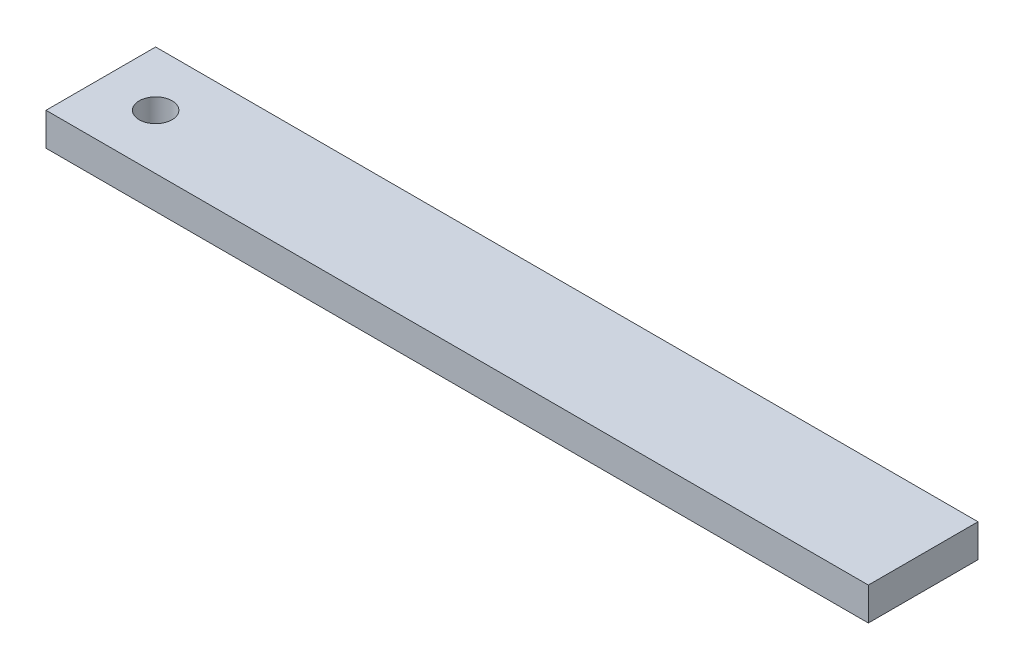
from build123d import *

# Parameters (mm, degrees)
SKETCH1_W           = 75
SKETCH1_H           = 10
SKETCH1_R           = 1.5
BOSS_EXTRUDE1_DEPTH = 3


with BuildPart() as part:
    # Sketch1 → Boss-Extrude1 (new body)
    with BuildSketch(Plane(origin=(0, 0, 0), x_dir=(1, 0, 0), z_dir=(0, 1, 0))):
        Rectangle(SKETCH1_W, SKETCH1_H)
        with Locations(Location((-32.5, 0, 0), (0, 0, 270))):
            Circle(SKETCH1_R, mode=Mode.SUBTRACT)
    extrude(amount=BOSS_EXTRUDE1_DEPTH)


solid = part.part
